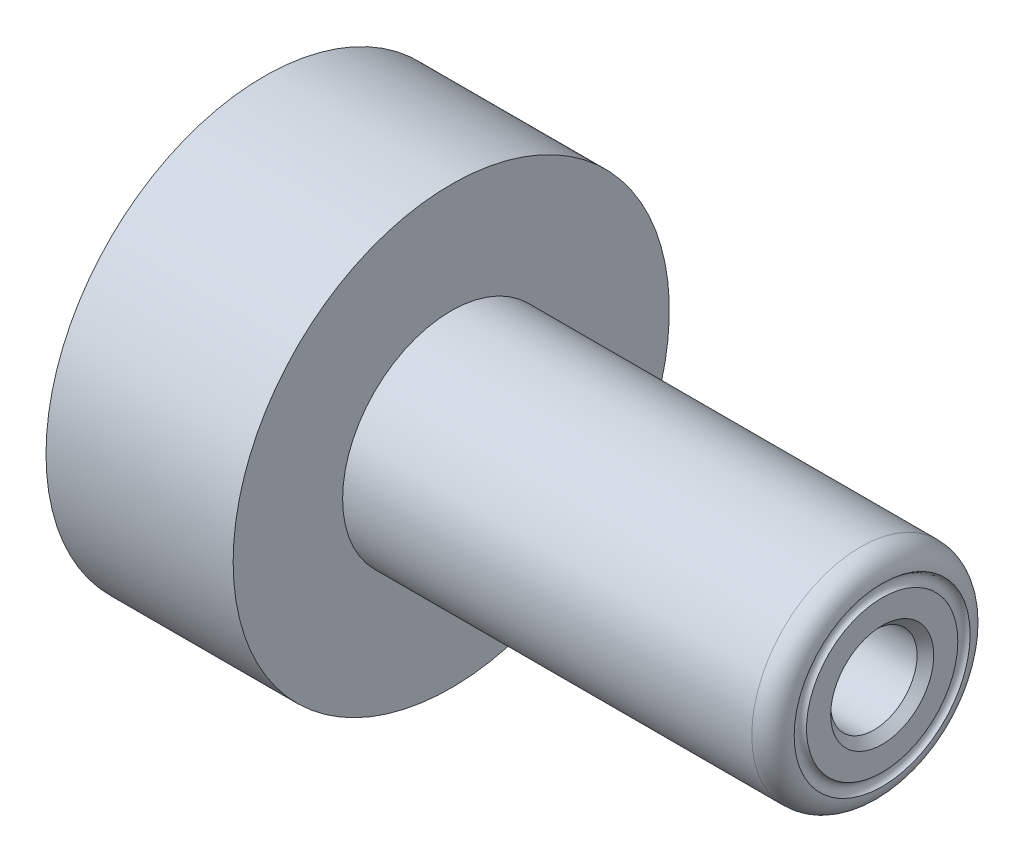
ISO-10303-21;
HEADER;
FILE_DESCRIPTION(('STEP AP214'),'2;1');
FILE_NAME('part.step','',(''),(''),'','','');
FILE_SCHEMA(('AUTOMOTIVE_DESIGN { 1 0 10303 214 1 1 1 1 }'));
ENDSEC;
DATA;
#1=APPLICATION_CONTEXT('core data for automotive mechanical design processes');
#2=APPLICATION_PROTOCOL_DEFINITION('international standard','automotive_design',2000,#1);
#3=PRODUCT_CONTEXT('',#1,'mechanical');
#4=PRODUCT('Part','Part','',(#3));
#5=PRODUCT_RELATED_PRODUCT_CATEGORY('part','',(#4));
#6=PRODUCT_DEFINITION_FORMATION('','',#4);
#7=PRODUCT_DEFINITION_CONTEXT('part definition',#1,'design');
#8=PRODUCT_DEFINITION('design','',#6,#7);
#9=PRODUCT_DEFINITION_SHAPE('','',#8);
#10=(LENGTH_UNIT() NAMED_UNIT(*) SI_UNIT(.MILLI.,.METRE.));
#11=(NAMED_UNIT(*) PLANE_ANGLE_UNIT() SI_UNIT($,.RADIAN.));
#12=(NAMED_UNIT(*) SI_UNIT($,.STERADIAN.) SOLID_ANGLE_UNIT());
#13=UNCERTAINTY_MEASURE_WITH_UNIT(LENGTH_MEASURE(1.E-05),#10,'distance_accuracy_value','');
#14=(GEOMETRIC_REPRESENTATION_CONTEXT(3) GLOBAL_UNCERTAINTY_ASSIGNED_CONTEXT((#13)) GLOBAL_UNIT_ASSIGNED_CONTEXT((#10,
#11,#12)) REPRESENTATION_CONTEXT('',''));
#15=CARTESIAN_POINT('',(0.,0.,0.));
#16=DIRECTION('',(0.,0.,1.));
#17=DIRECTION('',(1.,0.,0.));
#18=AXIS2_PLACEMENT_3D('',#15,#16,#17);
#19=CARTESIAN_POINT('',(35.9918,5.0546,0.));
#20=DIRECTION('',(-1.,0.,0.));
#21=DIRECTION('',(0.,0.,1.));
#22=AXIS2_PLACEMENT_3D('',#19,#20,#21);
#23=PLANE('',#22);
#24=CARTESIAN_POINT('',(35.9918,0.,0.));
#25=DIRECTION('',(-1.,0.,0.));
#26=DIRECTION('',(0.,0.,1.));
#27=AXIS2_PLACEMENT_3D('',#24,#25,#26);
#28=CIRCLE('',#27,3.);
#29=CARTESIAN_POINT('',(35.9918,0.,3.));
#30=VERTEX_POINT('',#29);
#31=EDGE_CURVE('E10',#30,#30,#28,.T.);
#32=ORIENTED_EDGE('',*,*,#31,.T.);
#33=EDGE_LOOP('',(#32));
#34=FACE_BOUND('',#33,.T.);
#35=CARTESIAN_POINT('',(35.9918,0.,0.));
#36=DIRECTION('',(1.,0.,0.));
#37=DIRECTION('',(0.,0.,-1.));
#38=AXIS2_PLACEMENT_3D('',#35,#36,#37);
#39=CIRCLE('',#38,4.40515842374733);
#40=CARTESIAN_POINT('',(35.9918,0.,-4.40515842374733));
#41=VERTEX_POINT('',#40);
#42=EDGE_CURVE('E82',#41,#41,#39,.F.);
#43=ORIENTED_EDGE('',*,*,#42,.F.);
#44=EDGE_LOOP('',(#43));
#45=FACE_BOUND('',#44,.T.);
#46=ADVANCED_FACE('F35',(#34,#45),#23,.F.);
#47=CARTESIAN_POINT('',(34.7218,0.,0.));
#48=DIRECTION('',(-1.,0.,0.));
#49=DIRECTION('',(0.,0.,1.));
#50=AXIS2_PLACEMENT_3D('',#47,#48,#49);
#51=TOROIDAL_SURFACE('',#50,5.0546,1.27);
#52=CARTESIAN_POINT('',(34.7218,0.,0.));
#53=DIRECTION('',(-1.,0.,0.));
#54=DIRECTION('',(0.,0.,1.));
#55=AXIS2_PLACEMENT_3D('',#52,#53,#54);
#56=CIRCLE('',#55,6.3246);
#57=CARTESIAN_POINT('',(34.7218,0.,6.3246));
#58=VERTEX_POINT('',#57);
#59=EDGE_CURVE('E52',#58,#58,#56,.T.);
#60=ORIENTED_EDGE('',*,*,#59,.F.);
#61=EDGE_LOOP('',(#60));
#62=FACE_BOUND('',#61,.T.);
#63=CARTESIAN_POINT('',(35.9898929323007,0.,0.));
#64=DIRECTION('',(1.,0.,0.));
#65=DIRECTION('',(0.,0.,-1.));
#66=AXIS2_PLACEMENT_3D('',#63,#64,#65);
#67=CIRCLE('',#66,5.12417237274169);
#68=CARTESIAN_POINT('',(35.9898929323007,0.,-5.12417237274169));
#69=VERTEX_POINT('',#68);
#70=EDGE_CURVE('E39',#69,#69,#67,.T.);
#71=ORIENTED_EDGE('',*,*,#70,.F.);
#72=EDGE_LOOP('',(#71));
#73=FACE_BOUND('',#72,.T.);
#74=ADVANCED_FACE('F91',(#62,#73),#51,.T.);
#75=CARTESIAN_POINT('',(0.,0.,0.));
#76=DIRECTION('',(-1.,0.,0.));
#77=DIRECTION('',(0.,0.,1.));
#78=AXIS2_PLACEMENT_3D('',#75,#76,#77);
#79=CYLINDRICAL_SURFACE('',#78,3.9751);
#80=CARTESIAN_POINT('',(21.8948,0.,0.));
#81=DIRECTION('',(-1.,0.,0.));
#82=DIRECTION('',(0.,0.,1.));
#83=AXIS2_PLACEMENT_3D('',#80,#81,#82);
#84=CIRCLE('',#83,3.9751);
#85=CARTESIAN_POINT('',(21.8948,0.,3.9751));
#86=VERTEX_POINT('',#85);
#87=EDGE_CURVE('E47',#86,#86,#84,.T.);
#88=ORIENTED_EDGE('',*,*,#87,.F.);
#89=EDGE_LOOP('',(#88));
#90=FACE_BOUND('',#89,.T.);
#91=CARTESIAN_POINT('',(0.,0.,0.));
#92=DIRECTION('',(-1.,0.,0.));
#93=DIRECTION('',(0.,0.,1.));
#94=AXIS2_PLACEMENT_3D('',#91,#92,#93);
#95=CIRCLE('',#94,3.9751);
#96=CARTESIAN_POINT('',(0.,0.,3.9751));
#97=VERTEX_POINT('',#96);
#98=EDGE_CURVE('E64',#97,#97,#95,.T.);
#99=ORIENTED_EDGE('',*,*,#98,.T.);
#100=EDGE_LOOP('',(#99));
#101=FACE_BOUND('',#100,.T.);
#102=ADVANCED_FACE('F93',(#90,#101),#79,.F.);
#103=CARTESIAN_POINT('',(21.8948,3.9751,0.));
#104=DIRECTION('',(1.,0.,0.));
#105=DIRECTION('',(0.,0.,-1.));
#106=AXIS2_PLACEMENT_3D('',#103,#104,#105);
#107=PLANE('',#106);
#108=CARTESIAN_POINT('',(21.8948,0.,0.));
#109=DIRECTION('',(1.,0.,0.));
#110=DIRECTION('',(0.,0.,-1.));
#111=AXIS2_PLACEMENT_3D('',#108,#109,#110);
#112=CIRCLE('',#111,2.515);
#113=CARTESIAN_POINT('',(21.8948,0.,-2.515));
#114=VERTEX_POINT('',#113);
#115=EDGE_CURVE('E77',#114,#114,#112,.T.);
#116=ORIENTED_EDGE('',*,*,#115,.T.);
#117=EDGE_LOOP('',(#116));
#118=FACE_BOUND('',#117,.T.);
#119=ORIENTED_EDGE('',*,*,#87,.T.);
#120=EDGE_LOOP('',(#119));
#121=FACE_BOUND('',#120,.T.);
#122=ADVANCED_FACE('F100',(#118,#121),#107,.F.);
#123=CARTESIAN_POINT('',(0.,0.,0.));
#124=DIRECTION('',(-1.,0.,0.));
#125=DIRECTION('',(0.,0.,1.));
#126=AXIS2_PLACEMENT_3D('',#123,#124,#125);
#127=CYLINDRICAL_SURFACE('',#126,6.3246);
#128=CARTESIAN_POINT('',(10.8966,0.,0.));
#129=DIRECTION('',(-1.,0.,0.));
#130=DIRECTION('',(0.,0.,1.));
#131=AXIS2_PLACEMENT_3D('',#128,#129,#130);
#132=CIRCLE('',#131,6.3246);
#133=CARTESIAN_POINT('',(10.8966,0.,6.3246));
#134=VERTEX_POINT('',#133);
#135=EDGE_CURVE('E55',#134,#134,#132,.T.);
#136=ORIENTED_EDGE('',*,*,#135,.F.);
#137=EDGE_LOOP('',(#136));
#138=FACE_BOUND('',#137,.T.);
#139=ORIENTED_EDGE('',*,*,#59,.T.);
#140=EDGE_LOOP('',(#139));
#141=FACE_BOUND('',#140,.T.);
#142=ADVANCED_FACE('F105',(#138,#141),#127,.T.);
#143=CARTESIAN_POINT('',(10.8966,12.7,0.));
#144=DIRECTION('',(-1.,0.,0.));
#145=DIRECTION('',(0.,0.,1.));
#146=AXIS2_PLACEMENT_3D('',#143,#144,#145);
#147=PLANE('',#146);
#148=CARTESIAN_POINT('',(10.8966,0.,0.));
#149=DIRECTION('',(-1.,0.,0.));
#150=DIRECTION('',(0.,0.,1.));
#151=AXIS2_PLACEMENT_3D('',#148,#149,#150);
#152=CIRCLE('',#151,12.7);
#153=CARTESIAN_POINT('',(10.8966,0.,12.7));
#154=VERTEX_POINT('',#153);
#155=EDGE_CURVE('E58',#154,#154,#152,.T.);
#156=ORIENTED_EDGE('',*,*,#155,.F.);
#157=EDGE_LOOP('',(#156));
#158=FACE_BOUND('',#157,.T.);
#159=ORIENTED_EDGE('',*,*,#135,.T.);
#160=EDGE_LOOP('',(#159));
#161=FACE_BOUND('',#160,.T.);
#162=ADVANCED_FACE('F113',(#158,#161),#147,.F.);
#163=CARTESIAN_POINT('',(0.,0.,0.));
#164=DIRECTION('',(-1.,0.,0.));
#165=DIRECTION('',(0.,0.,1.));
#166=AXIS2_PLACEMENT_3D('',#163,#164,#165);
#167=CYLINDRICAL_SURFACE('',#166,12.7);
#168=CARTESIAN_POINT('',(0.,0.,0.));
#169=DIRECTION('',(-1.,0.,0.));
#170=DIRECTION('',(0.,0.,1.));
#171=AXIS2_PLACEMENT_3D('',#168,#169,#170);
#172=CIRCLE('',#171,12.7);
#173=CARTESIAN_POINT('',(0.,0.,12.7));
#174=VERTEX_POINT('',#173);
#175=EDGE_CURVE('E61',#174,#174,#172,.T.);
#176=ORIENTED_EDGE('',*,*,#175,.F.);
#177=EDGE_LOOP('',(#176));
#178=FACE_BOUND('',#177,.T.);
#179=ORIENTED_EDGE('',*,*,#155,.T.);
#180=EDGE_LOOP('',(#179));
#181=FACE_BOUND('',#180,.T.);
#182=ADVANCED_FACE('F125',(#178,#181),#167,.T.);
#183=CARTESIAN_POINT('',(0.,3.9751,0.));
#184=DIRECTION('',(1.,0.,0.));
#185=DIRECTION('',(0.,0.,-1.));
#186=AXIS2_PLACEMENT_3D('',#183,#184,#185);
#187=PLANE('',#186);
#188=CARTESIAN_POINT('',(0.,0.,7.1374));
#189=DIRECTION('',(-1.,0.,0.));
#190=DIRECTION('',(0.,0.,-1.));
#191=AXIS2_PLACEMENT_3D('',#188,#189,#190);
#192=CIRCLE('',#191,1.6129);
#193=CARTESIAN_POINT('',(0.,0.,5.5245));
#194=VERTEX_POINT('',#193);
#195=EDGE_CURVE('E74',#194,#194,#192,.T.);
#196=ORIENTED_EDGE('',*,*,#195,.F.);
#197=EDGE_LOOP('',(#196));
#198=FACE_BOUND('',#197,.T.);
#199=CARTESIAN_POINT('',(0.,0.,-7.1374));
#200=DIRECTION('',(-1.,0.,0.));
#201=DIRECTION('',(0.,0.,1.));
#202=AXIS2_PLACEMENT_3D('',#199,#200,#201);
#203=CIRCLE('',#202,1.6129);
#204=CARTESIAN_POINT('',(0.,0.,-5.5245));
#205=VERTEX_POINT('',#204);
#206=EDGE_CURVE('E68',#205,#205,#203,.T.);
#207=ORIENTED_EDGE('',*,*,#206,.F.);
#208=EDGE_LOOP('',(#207));
#209=FACE_BOUND('',#208,.T.);
#210=ORIENTED_EDGE('',*,*,#98,.F.);
#211=EDGE_LOOP('',(#210));
#212=FACE_BOUND('',#211,.T.);
#213=ORIENTED_EDGE('',*,*,#175,.T.);
#214=EDGE_LOOP('',(#213));
#215=FACE_BOUND('',#214,.T.);
#216=ADVANCED_FACE('F121',(#198,#209,#212,#215),#187,.F.);
#217=CARTESIAN_POINT('',(6.35,0.,-7.1374));
#218=DIRECTION('',(-1.,0.,0.));
#219=DIRECTION('',(0.,0.,1.));
#220=AXIS2_PLACEMENT_3D('',#217,#218,#219);
#221=CYLINDRICAL_SURFACE('',#220,1.6129);
#222=CARTESIAN_POINT('',(6.35,0.,-7.1374));
#223=DIRECTION('',(-1.,0.,0.));
#224=DIRECTION('',(0.,0.,1.));
#225=AXIS2_PLACEMENT_3D('',#222,#223,#224);
#226=CIRCLE('',#225,1.6129);
#227=CARTESIAN_POINT('',(6.35,0.,-5.5245));
#228=VERTEX_POINT('',#227);
#229=EDGE_CURVE('E67',#228,#228,#226,.T.);
#230=ORIENTED_EDGE('',*,*,#229,.F.);
#231=EDGE_LOOP('',(#230));
#232=FACE_BOUND('',#231,.T.);
#233=ORIENTED_EDGE('',*,*,#206,.T.);
#234=EDGE_LOOP('',(#233));
#235=FACE_BOUND('',#234,.T.);
#236=ADVANCED_FACE('F124',(#232,#235),#221,.F.);
#237=CARTESIAN_POINT('',(6.35,0.,-7.1374));
#238=DIRECTION('',(-1.,0.,0.));
#239=DIRECTION('',(0.,0.,1.));
#240=AXIS2_PLACEMENT_3D('',#237,#238,#239);
#241=PLANE('',#240);
#242=ORIENTED_EDGE('',*,*,#229,.T.);
#243=EDGE_LOOP('',(#242));
#244=FACE_BOUND('',#243,.T.);
#245=ADVANCED_FACE('F144',(#244),#241,.T.);
#246=CARTESIAN_POINT('',(6.35,0.,7.1374));
#247=DIRECTION('',(-1.,0.,0.));
#248=DIRECTION('',(0.,0.,1.));
#249=AXIS2_PLACEMENT_3D('',#246,#247,#248);
#250=CYLINDRICAL_SURFACE('',#249,1.6129);
#251=CARTESIAN_POINT('',(6.35,0.,7.1374));
#252=DIRECTION('',(-1.,0.,0.));
#253=DIRECTION('',(0.,0.,-1.));
#254=AXIS2_PLACEMENT_3D('',#251,#252,#253);
#255=CIRCLE('',#254,1.6129);
#256=CARTESIAN_POINT('',(6.35,0.,5.5245));
#257=VERTEX_POINT('',#256);
#258=EDGE_CURVE('E71',#257,#257,#255,.T.);
#259=ORIENTED_EDGE('',*,*,#258,.F.);
#260=EDGE_LOOP('',(#259));
#261=FACE_BOUND('',#260,.T.);
#262=ORIENTED_EDGE('',*,*,#195,.T.);
#263=EDGE_LOOP('',(#262));
#264=FACE_BOUND('',#263,.T.);
#265=ADVANCED_FACE('F148',(#261,#264),#250,.F.);
#266=CARTESIAN_POINT('',(6.35,0.,7.1374));
#267=DIRECTION('',(1.,0.,0.));
#268=DIRECTION('',(0.,0.,-1.));
#269=AXIS2_PLACEMENT_3D('',#266,#267,#268);
#270=PLANE('',#269);
#271=ORIENTED_EDGE('',*,*,#258,.T.);
#272=EDGE_LOOP('',(#271));
#273=FACE_BOUND('',#272,.T.);
#274=ADVANCED_FACE('F152',(#273),#270,.F.);
#275=CARTESIAN_POINT('',(0.,0.,0.));
#276=DIRECTION('',(1.,0.,0.));
#277=DIRECTION('',(0.,0.,-1.));
#278=AXIS2_PLACEMENT_3D('',#275,#276,#277);
#279=CYLINDRICAL_SURFACE('',#278,2.515);
#280=CARTESIAN_POINT('',(35.5068,0.,0.));
#281=DIRECTION('',(-1.,0.,0.));
#282=DIRECTION('',(0.,0.,1.));
#283=AXIS2_PLACEMENT_3D('',#280,#281,#282);
#284=CIRCLE('',#283,2.515);
#285=CARTESIAN_POINT('',(35.5068,0.,2.515));
#286=VERTEX_POINT('',#285);
#287=EDGE_CURVE('E43',#286,#286,#284,.F.);
#288=ORIENTED_EDGE('',*,*,#287,.T.);
#289=EDGE_LOOP('',(#288));
#290=FACE_BOUND('',#289,.T.);
#291=ORIENTED_EDGE('',*,*,#115,.F.);
#292=EDGE_LOOP('',(#291));
#293=FACE_BOUND('',#292,.T.);
#294=ADVANCED_FACE('F156',(#290,#293),#279,.F.);
#295=CARTESIAN_POINT('',(35.5068,0.,0.));
#296=DIRECTION('',(1.,0.,0.));
#297=DIRECTION('',(0.,0.,-1.));
#298=AXIS2_PLACEMENT_3D('',#295,#296,#297);
#299=CONICAL_SURFACE('',#298,2.515,0.785398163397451);
#300=ORIENTED_EDGE('',*,*,#31,.F.);
#301=EDGE_LOOP('',(#300));
#302=FACE_BOUND('',#301,.T.);
#303=ORIENTED_EDGE('',*,*,#287,.F.);
#304=EDGE_LOOP('',(#303));
#305=FACE_BOUND('',#304,.T.);
#306=ADVANCED_FACE('F37',(#302,#305),#299,.F.);
#307=CARTESIAN_POINT('',(36.117,0.,0.));
#308=DIRECTION('',(-1.,0.,0.));
#309=DIRECTION('',(0.,0.,1.));
#310=AXIS2_PLACEMENT_3D('',#307,#308,#309);
#311=TOROIDAL_SURFACE('',#310,4.765,0.381000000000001);
#312=ORIENTED_EDGE('',*,*,#70,.T.);
#313=EDGE_LOOP('',(#312));
#314=FACE_BOUND('',#313,.T.);
#315=ORIENTED_EDGE('',*,*,#42,.T.);
#316=EDGE_LOOP('',(#315));
#317=FACE_BOUND('',#316,.T.);
#318=ADVANCED_FACE('F89',(#314,#317),#311,.F.);
#319=CLOSED_SHELL('',(#46,#74,#102,#122,#142,#162,#182,#216,#236,#245,#265,#274,#294,#306,#318));
#320=MANIFOLD_SOLID_BREP('B2',#319);
#321=ADVANCED_BREP_SHAPE_REPRESENTATION('',(#18,#320),#14);
#322=SHAPE_DEFINITION_REPRESENTATION(#9,#321);
ENDSEC;
END-ISO-10303-21;
